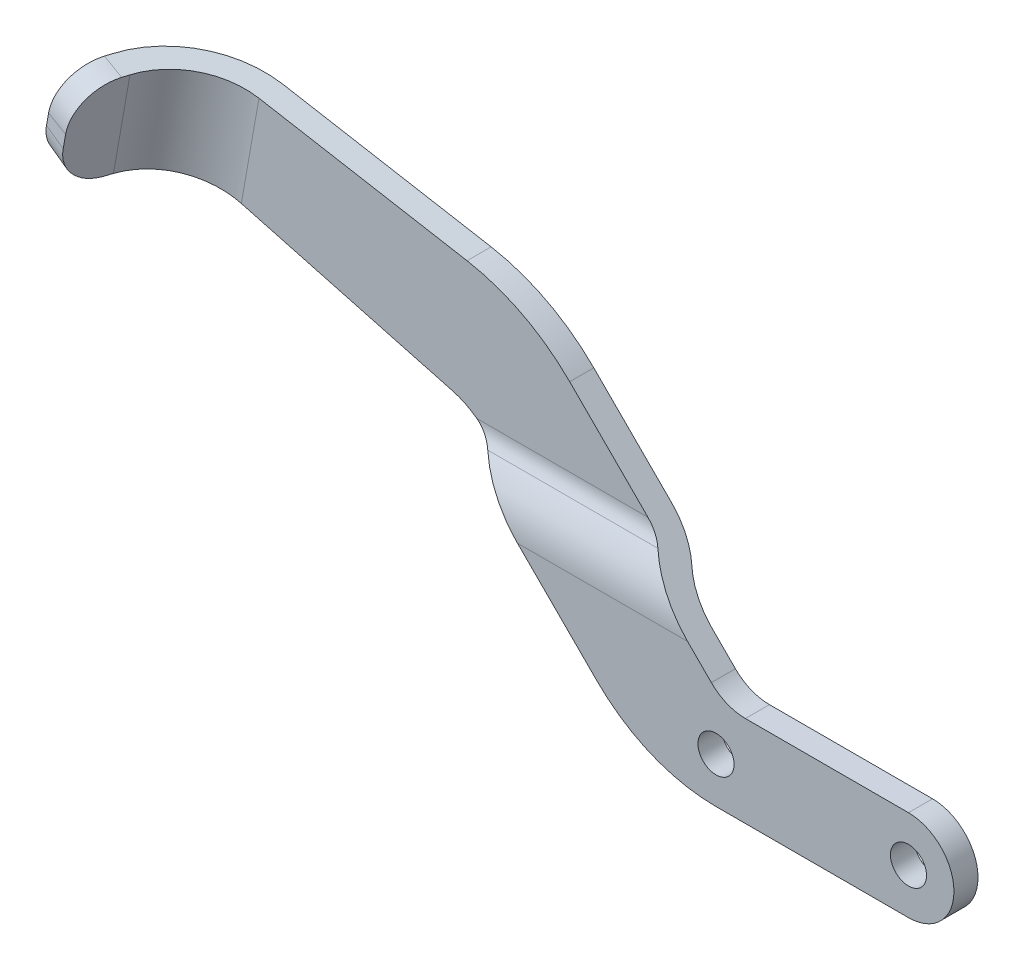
from build123d import *

# Parameters (mm, degrees)
BASE_EXTRUDE_DEPTH      = 3.175
CUT_EXTRUDE1_DEPTH      = 101.324569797
CUT_EXTRUDE1_DEPTH_BACK = 101.324569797
CUT_EXTRUDE2_DEPTH      = 101.3245698
SKETCH4_R               = 2.38125
CUT_EXTRUDE3_DEPTH      = 101.47517694
BOSS_EXTRUDE1_REACH     = 102.663
FILLET4_R               = 5.334


with BuildPart() as part:
    # Sketch1 → Base-Extrude (new, symmetric)
    with BuildSketch(Plane.XY):
        with BuildLine():
            Line((0, 6), (-21.525, 6))
            ThreePointArc((-21.525, 6), (-23.955039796, 6.483364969), (-26.015128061, 7.859871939))
            Line((-26.015128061, 7.859871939), (-47.883548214, 29.728292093))
            ThreePointArc((-47.883548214, 29.728292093), (-54.11564568, 34.297855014), (-61.433396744, 36.781896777))
            Line((-61.433396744, 36.781896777), (-88.9, 41.625))
            Line((-88.9, 41.625), (-91.226630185, 28.43002453))
            Line((-91.226630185, 28.43002453), (-63.378809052, 20.968223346))
            ThreePointArc((-63.378809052, 20.968223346), (-61.081560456, 20.016671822), (-59.108868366, 18.502971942))
            Line((-59.108868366, 18.502971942), (-41.115448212, 0.509551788))
            ThreePointArc((-41.115448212, 0.509551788), (-33.905139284, -4.30822261), (-25.4, -6))
            Line((-25.4, -6), (0, -6))
            ThreePointArc((0, -6), (6, 0), (0, 6))
        make_face()
    extrude(amount=BASE_EXTRUDE_DEPTH, both=True)

    # Sketch2 → Cut-Extrude1 (cut, two sides: drawn at the far end of the back side and taken through both)
    with BuildSketch(Plane(origin=(0, 0, 0), x_dir=(0, 0, -1), z_dir=(1, 0, 0)).offset(-CUT_EXTRUDE1_DEPTH_BACK)):
        with BuildLine():
            Line((109.267936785, -6), (3.175, -6))
            Line((3.175, -6), (0, -6))
            Line((0, -6), (0, 10.999739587))
            ThreePointArc((0, 10.999739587), (0.410118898, 13.244803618), (1.5875, 15.199869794))
            ThreePointArc((1.5875, 15.199869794), (2.764881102, 17.15493597), (3.175, 19.4))
            Line((3.175, 19.4), (3.175, 125.492936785))
            Line((3.175, 125.492936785), (168.312411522, 258.731370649))
            Line((168.312411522, 258.731370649), (274.405348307, 127.238433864))
            Line((274.405348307, 127.238433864), (109.267936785, -6))
        make_face()
    extrude(amount=CUT_EXTRUDE1_DEPTH + CUT_EXTRUDE1_DEPTH_BACK, mode=Mode.SUBTRACT)

    # Sketch3 → Cut-Extrude2 (cut, through all)
    with BuildSketch(Plane(origin=(0, 0, 0), x_dir=(0, 0, -1), z_dir=(1, 0, 0))):
        with BuildLine():
            Line((0, 19.4), (0, 41.625))
            Line((0, 41.625), (-3.175, 41.625))
            Line((-3.175, 41.625), (-3.175, 10.999739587))
            ThreePointArc((-3.175, 10.999739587), (-2.559821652, 14.367335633), (-0.79375, 17.299934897))
            ThreePointArc((-0.79375, 17.299934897), (-0.205059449, 18.277467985), (0, 19.4))
        make_face()
    extrude(amount=-CUT_EXTRUDE2_DEPTH, mode=Mode.SUBTRACT)

    # Sketch4 → Cut-Extrude3 (cut, through all)
    with BuildSketch(Plane.XY.offset(3.175)):
        Circle(SKETCH4_R)
        with Locations((-25.4, 0)):
            Circle(SKETCH4_R)
    extrude(amount=-CUT_EXTRUDE3_DEPTH, mode=Mode.SUBTRACT)

    # Boss-Extrude1: up to this plane
    boss_extrude1_end = Plane(origin=(-63.378809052, 20.968223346, 3.175), z_dir=(-0.2588190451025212, -0.9659258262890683, 0))
    # Sketch6 → Boss-Extrude1 (add, up to the surface)
    with BuildSketch(Plane(origin=(4.437631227, 25.167057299, 0), x_dir=(-0.9848077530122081, 0.1736481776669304, 0), z_dir=(0.17364817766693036, 0.984807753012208, 0)), mode=Mode.PRIVATE) as boss_extrude1_sk1:
        with BuildLine():
            Line((94.777514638, -3.175), (94.777514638, 0))
            ThreePointArc((94.777514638, 0), (100.893829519, 2.100047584), (104.430088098, 7.51432342))
            Line((104.430088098, 7.51432342), (105.962866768, 13.571805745))
            Line((105.962866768, 13.571805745), (109.040855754, 12.792954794))
            Line((109.040855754, 12.792954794), (107.508077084, 6.73547247))
            ThreePointArc((107.508077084, 6.73547247), (102.844185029, -0.405294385), (94.777514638, -3.175))
        make_face()
    boss_extrude1_tool1 = split(extrude(boss_extrude1_sk1.sketch, amount=-BOSS_EXTRUDE1_REACH, mode=Mode.PRIVATE), bisect_by=boss_extrude1_end, keep=Keep.BOTH, mode=Mode.PRIVATE)
    add(boss_extrude1_tool1.solids().sort_by_distance((-96.950625, 43.044542, 3.972737))[0])

    # Fillet4
    fillet4_edges = [part.edges().sort_by_distance(p)[0] for p in [
        (-103.564353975, 31.735907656, 13.182380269),
        (-101.431035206, 43.834559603, 13.182380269),
    ]]
    fillet(fillet4_edges, radius=FILLET4_R)


solid = part.part
